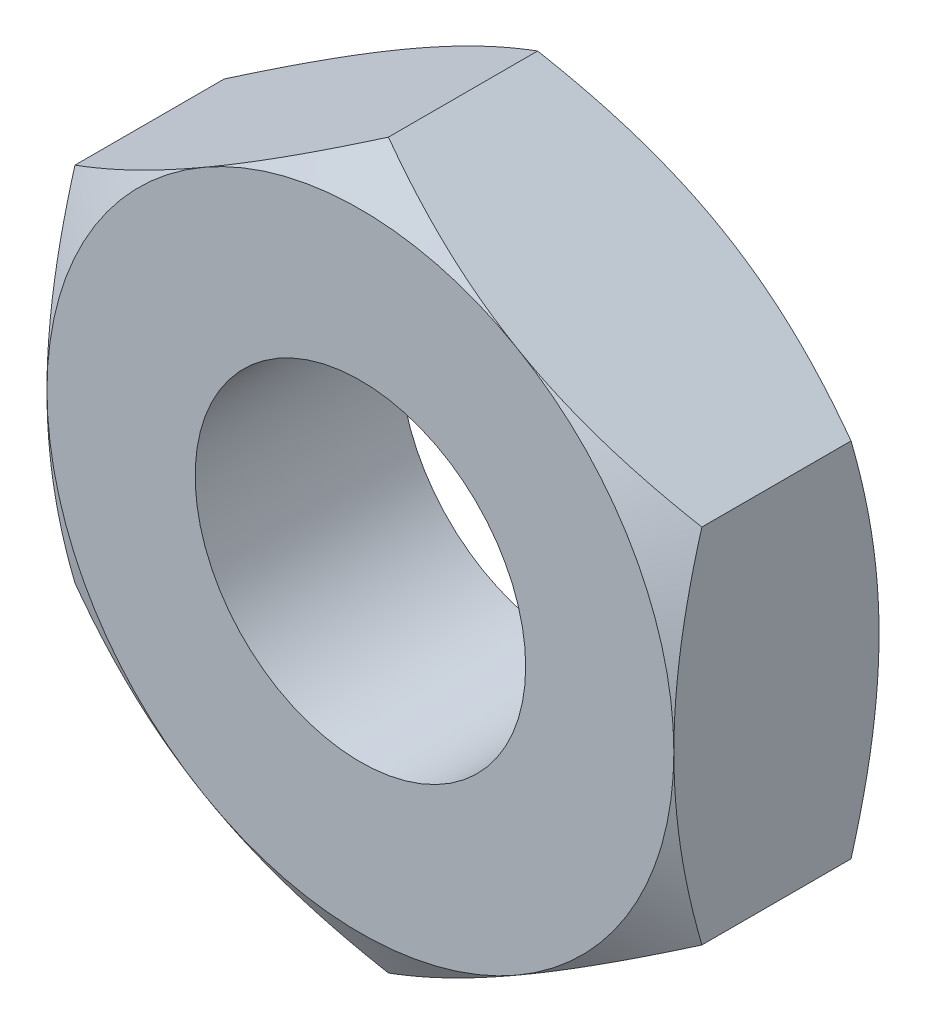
ISO-10303-21;
HEADER;
FILE_DESCRIPTION(('STEP AP214'),'2;1');
FILE_NAME('part.step','',(''),(''),'','','');
FILE_SCHEMA(('AUTOMOTIVE_DESIGN { 1 0 10303 214 1 1 1 1 }'));
ENDSEC;
DATA;
#1=APPLICATION_CONTEXT('core data for automotive mechanical design processes');
#2=APPLICATION_PROTOCOL_DEFINITION('international standard','automotive_design',2000,#1);
#3=PRODUCT_CONTEXT('',#1,'mechanical');
#4=PRODUCT('Part','Part','',(#3));
#5=PRODUCT_RELATED_PRODUCT_CATEGORY('part','',(#4));
#6=PRODUCT_DEFINITION_FORMATION('','',#4);
#7=PRODUCT_DEFINITION_CONTEXT('part definition',#1,'design');
#8=PRODUCT_DEFINITION('design','',#6,#7);
#9=PRODUCT_DEFINITION_SHAPE('','',#8);
#10=(LENGTH_UNIT() NAMED_UNIT(*) SI_UNIT(.MILLI.,.METRE.));
#11=(NAMED_UNIT(*) PLANE_ANGLE_UNIT() SI_UNIT($,.RADIAN.));
#12=(NAMED_UNIT(*) SI_UNIT($,.STERADIAN.) SOLID_ANGLE_UNIT());
#13=UNCERTAINTY_MEASURE_WITH_UNIT(LENGTH_MEASURE(1.E-05),#10,'distance_accuracy_value','');
#14=(GEOMETRIC_REPRESENTATION_CONTEXT(3) GLOBAL_UNCERTAINTY_ASSIGNED_CONTEXT((#13)) GLOBAL_UNIT_ASSIGNED_CONTEXT((#10,
#11,#12)) REPRESENTATION_CONTEXT('',''));
#15=CARTESIAN_POINT('',(0.,0.,0.));
#16=DIRECTION('',(0.,0.,1.));
#17=DIRECTION('',(1.,0.,0.));
#18=AXIS2_PLACEMENT_3D('',#15,#16,#17);
#19=CARTESIAN_POINT('',(0.,3.17542648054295,-1.8));
#20=DIRECTION('',(-0.500000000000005,0.866025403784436,0.));
#21=DIRECTION('',(-0.866025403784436,-0.500000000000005,0.));
#22=AXIS2_PLACEMENT_3D('',#19,#20,#21);
#23=PLANE('',#22);
#24=DIRECTION('',(0.,0.,1.));
#25=VECTOR('',#24,1.);
#26=CARTESIAN_POINT('',(-2.75,1.58771324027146,-1.8));
#27=LINE('',#26,#25);
#28=CARTESIAN_POINT('',(-2.75,1.58771324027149,-1.55437990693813));
#29=VERTEX_POINT('',#28);
#30=CARTESIAN_POINT('',(-2.75,1.58771324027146,-0.24562009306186));
#31=VERTEX_POINT('',#30);
#32=EDGE_CURVE('E153',#29,#31,#27,.T.);
#33=ORIENTED_EDGE('',*,*,#32,.T.);
#34=CARTESIAN_POINT('',(-2.7502,1.58759777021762,-0.245686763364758));
#35=CARTESIAN_POINT('',(-2.62935077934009,1.65737010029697,-0.20538766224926));
#36=CARTESIAN_POINT('',(-2.50745839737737,1.72774469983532,-0.168736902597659));
#37=CARTESIAN_POINT('',(-2.26156287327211,1.86971254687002,-0.104762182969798));
#38=CARTESIAN_POINT('',(-2.13755536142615,1.94130831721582,-0.0774608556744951));
#39=CARTESIAN_POINT('',(-1.89107720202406,2.08361254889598,-0.034961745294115));
#40=CARTESIAN_POINT('',(-1.76864448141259,2.15429911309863,-0.019481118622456));
#41=CARTESIAN_POINT('',(-1.52320285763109,2.29600490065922,-0.000999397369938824));
#42=CARTESIAN_POINT('',(-1.40019484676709,2.36702360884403,0.00201700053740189));
#43=CARTESIAN_POINT('',(-1.17034121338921,2.49972966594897,-0.00425314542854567));
#44=CARTESIAN_POINT('',(-1.06346120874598,2.56143686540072,-0.0120001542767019));
#45=CARTESIAN_POINT('',(-0.850397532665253,2.68444923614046,-0.0365551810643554));
#46=CARTESIAN_POINT('',(-0.744214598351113,2.74575398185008,-0.0533715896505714));
#47=CARTESIAN_POINT('',(-0.530711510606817,2.86902004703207,-0.0954119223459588));
#48=CARTESIAN_POINT('',(-0.423418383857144,2.93096576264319,-0.120814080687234));
#49=CARTESIAN_POINT('',(-0.210432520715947,3.05393320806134,-0.178467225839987));
#50=CARTESIAN_POINT('',(-0.104737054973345,3.11495651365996,-0.210704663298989));
#51=CARTESIAN_POINT('',(0.000200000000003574,3.17554195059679,-0.245686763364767));
#52=B_SPLINE_CURVE_WITH_KNOTS('',3,(#34,#35,#36,#37,#38,#39,#40,#41,#42,#43,#44,#45,#46,#47,#48,
#49,#50,#51),.UNSPECIFIED.,.F.,.F.,(4,2,2,2,2,2,2,2,4),(0.,0.435912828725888,0.872873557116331,
1.29901931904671,1.72464171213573,2.09526089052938,2.46622354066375,2.84541551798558,
3.22386274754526),.UNSPECIFIED.);
#53=CARTESIAN_POINT('',(-1.37500000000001,2.3815698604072,0.));
#54=VERTEX_POINT('',#53);
#55=EDGE_CURVE('E122',#31,#54,#52,.T.);
#56=ORIENTED_EDGE('',*,*,#55,.T.);
#57=CARTESIAN_POINT('',(0.,3.17542648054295,-0.245620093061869));
#58=VERTEX_POINT('',#57);
#59=EDGE_CURVE('E42',#54,#58,#52,.T.);
#60=ORIENTED_EDGE('',*,*,#59,.T.);
#61=DIRECTION('',(0.,0.,1.));
#62=VECTOR('',#61,1.);
#63=CARTESIAN_POINT('',(0.,3.17542648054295,-1.8));
#64=LINE('',#63,#62);
#65=CARTESIAN_POINT('',(0.,3.17542648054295,-1.55437990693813));
#66=VERTEX_POINT('',#65);
#67=EDGE_CURVE('E138',#66,#58,#64,.T.);
#68=ORIENTED_EDGE('',*,*,#67,.F.);
#69=CARTESIAN_POINT('',(-2.7502,1.58759777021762,-1.55431323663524));
#70=CARTESIAN_POINT('',(-2.62935077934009,1.65737010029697,-1.59461233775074));
#71=CARTESIAN_POINT('',(-2.50745839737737,1.72774469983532,-1.63126309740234));
#72=CARTESIAN_POINT('',(-2.26156287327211,1.86971254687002,-1.6952378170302));
#73=CARTESIAN_POINT('',(-2.13755536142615,1.94130831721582,-1.7225391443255));
#74=CARTESIAN_POINT('',(-1.89107720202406,2.08361254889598,-1.76503825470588));
#75=CARTESIAN_POINT('',(-1.76864448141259,2.15429911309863,-1.78051888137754));
#76=CARTESIAN_POINT('',(-1.52320285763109,2.29600490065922,-1.79900060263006));
#77=CARTESIAN_POINT('',(-1.40019484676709,2.36702360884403,-1.8020170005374));
#78=CARTESIAN_POINT('',(-1.17034121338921,2.49972966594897,-1.79574685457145));
#79=CARTESIAN_POINT('',(-1.06346120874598,2.56143686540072,-1.7879998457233));
#80=CARTESIAN_POINT('',(-0.850397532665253,2.68444923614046,-1.76344481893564));
#81=CARTESIAN_POINT('',(-0.744214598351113,2.74575398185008,-1.74662841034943));
#82=CARTESIAN_POINT('',(-0.530711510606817,2.86902004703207,-1.70458807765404));
#83=CARTESIAN_POINT('',(-0.423418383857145,2.93096576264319,-1.67918591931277));
#84=CARTESIAN_POINT('',(-0.210432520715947,3.05393320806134,-1.62153277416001));
#85=CARTESIAN_POINT('',(-0.104737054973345,3.11495651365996,-1.58929533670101));
#86=CARTESIAN_POINT('',(0.000200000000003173,3.17554195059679,-1.55431323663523));
#87=B_SPLINE_CURVE_WITH_KNOTS('',3,(#69,#70,#71,#72,#73,#74,#75,#76,#77,#78,#79,#80,#81,#82,#83,
#84,#85,#86),.UNSPECIFIED.,.F.,.F.,(4,2,2,2,2,2,2,2,4),(0.,0.435912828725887,0.872873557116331,
1.29901931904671,1.72464171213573,2.09526089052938,2.46622354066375,2.84541551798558,
3.22386274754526),.UNSPECIFIED.);
#88=CARTESIAN_POINT('',(-1.37500000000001,2.3815698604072,-1.8));
#89=VERTEX_POINT('',#88);
#90=EDGE_CURVE('E155',#89,#66,#87,.T.);
#91=ORIENTED_EDGE('',*,*,#90,.F.);
#92=EDGE_CURVE('E190',#29,#89,#87,.T.);
#93=ORIENTED_EDGE('',*,*,#92,.F.);
#94=EDGE_LOOP('',(#33,#56,#60,#68,#91,#93));
#95=FACE_BOUND('',#94,.T.);
#96=ADVANCED_FACE('F26',(#95),#23,.T.);
#97=CARTESIAN_POINT('',(2.75,1.58771324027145,-1.8));
#98=DIRECTION('',(0.500000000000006,0.866025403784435,0.));
#99=DIRECTION('',(-0.866025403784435,0.500000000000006,0.));
#100=AXIS2_PLACEMENT_3D('',#97,#98,#99);
#101=PLANE('',#100);
#102=ORIENTED_EDGE('',*,*,#67,.T.);
#103=CARTESIAN_POINT('',(-0.00019999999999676,3.17554195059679,-0.245686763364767));
#104=CARTESIAN_POINT('',(0.120649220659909,3.10576962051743,-0.205387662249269));
#105=CARTESIAN_POINT('',(0.242541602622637,3.03539502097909,-0.168736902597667));
#106=CARTESIAN_POINT('',(0.488437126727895,2.89342717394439,-0.104762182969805));
#107=CARTESIAN_POINT('',(0.612444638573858,2.82183140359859,-0.0774608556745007));
#108=CARTESIAN_POINT('',(0.858922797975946,2.67952717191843,-0.0349617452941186));
#109=CARTESIAN_POINT('',(0.98135551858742,2.60884060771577,-0.0194811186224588));
#110=CARTESIAN_POINT('',(1.22679714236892,2.46713482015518,-0.00099939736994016));
#111=CARTESIAN_POINT('',(1.34980515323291,2.39611611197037,0.00201700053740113));
#112=CARTESIAN_POINT('',(1.57965878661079,2.26341005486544,-0.00425314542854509));
#113=CARTESIAN_POINT('',(1.68653879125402,2.20170285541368,-0.0120001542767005));
#114=CARTESIAN_POINT('',(1.89960246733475,2.07869048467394,-0.0365551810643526));
#115=CARTESIAN_POINT('',(2.00578540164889,2.01738573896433,-0.0533715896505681));
#116=CARTESIAN_POINT('',(2.21928848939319,1.89411967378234,-0.0954119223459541));
#117=CARTESIAN_POINT('',(2.32658161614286,1.83217395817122,-0.120814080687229));
#118=CARTESIAN_POINT('',(2.53956747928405,1.70920651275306,-0.17846722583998));
#119=CARTESIAN_POINT('',(2.64526294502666,1.64818320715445,-0.21070466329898));
#120=CARTESIAN_POINT('',(2.7502,1.58759777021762,-0.245686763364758));
#121=B_SPLINE_CURVE_WITH_KNOTS('',3,(#103,#104,#105,#106,#107,#108,#109,#110,#111,#112,#113,
#114,#115,#116,#117,#118,#119,#120),.UNSPECIFIED.,.F.,.F.,(4,2,2,2,2,2,2,2,4),(0.,
0.43591282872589,0.872873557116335,1.29901931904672,1.72464171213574,2.09526089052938,
2.46622354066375,2.84541551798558,3.22386274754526),.UNSPECIFIED.);
#122=CARTESIAN_POINT('',(1.37500000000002,2.3815698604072,0.));
#123=VERTEX_POINT('',#122);
#124=EDGE_CURVE('E132',#58,#123,#121,.T.);
#125=ORIENTED_EDGE('',*,*,#124,.T.);
#126=CARTESIAN_POINT('',(2.75,1.58771324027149,-0.245620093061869));
#127=VERTEX_POINT('',#126);
#128=EDGE_CURVE('E49',#123,#127,#121,.T.);
#129=ORIENTED_EDGE('',*,*,#128,.T.);
#130=DIRECTION('',(0.,0.,1.));
#131=VECTOR('',#130,1.);
#132=CARTESIAN_POINT('',(2.75,1.58771324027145,-1.8));
#133=LINE('',#132,#131);
#134=CARTESIAN_POINT('',(2.75,1.58771324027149,-1.55437990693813));
#135=VERTEX_POINT('',#134);
#136=EDGE_CURVE('E131',#135,#127,#133,.T.);
#137=ORIENTED_EDGE('',*,*,#136,.F.);
#138=CARTESIAN_POINT('',(-0.00019999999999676,3.17554195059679,-1.55431323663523));
#139=CARTESIAN_POINT('',(0.120649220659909,3.10576962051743,-1.59461233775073));
#140=CARTESIAN_POINT('',(0.242541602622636,3.03539502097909,-1.63126309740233));
#141=CARTESIAN_POINT('',(0.488437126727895,2.89342717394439,-1.6952378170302));
#142=CARTESIAN_POINT('',(0.612444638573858,2.82183140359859,-1.7225391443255));
#143=CARTESIAN_POINT('',(0.858922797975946,2.67952717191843,-1.76503825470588));
#144=CARTESIAN_POINT('',(0.981355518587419,2.60884060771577,-1.78051888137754));
#145=CARTESIAN_POINT('',(1.22679714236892,2.46713482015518,-1.79900060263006));
#146=CARTESIAN_POINT('',(1.34980515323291,2.39611611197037,-1.8020170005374));
#147=CARTESIAN_POINT('',(1.57965878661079,2.26341005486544,-1.79574685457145));
#148=CARTESIAN_POINT('',(1.68653879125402,2.20170285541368,-1.7879998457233));
#149=CARTESIAN_POINT('',(1.89960246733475,2.07869048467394,-1.76344481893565));
#150=CARTESIAN_POINT('',(2.00578540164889,2.01738573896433,-1.74662841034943));
#151=CARTESIAN_POINT('',(2.21928848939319,1.89411967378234,-1.70458807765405));
#152=CARTESIAN_POINT('',(2.32658161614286,1.83217395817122,-1.67918591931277));
#153=CARTESIAN_POINT('',(2.53956747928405,1.70920651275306,-1.62153277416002));
#154=CARTESIAN_POINT('',(2.64526294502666,1.64818320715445,-1.58929533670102));
#155=CARTESIAN_POINT('',(2.7502,1.58759777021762,-1.55431323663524));
#156=B_SPLINE_CURVE_WITH_KNOTS('',3,(#138,#139,#140,#141,#142,#143,#144,#145,#146,#147,#148,
#149,#150,#151,#152,#153,#154,#155),.UNSPECIFIED.,.F.,.F.,(4,2,2,2,2,2,2,2,4),(0.,
0.43591282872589,0.872873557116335,1.29901931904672,1.72464171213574,2.09526089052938,
2.46622354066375,2.84541551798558,3.22386274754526),.UNSPECIFIED.);
#157=CARTESIAN_POINT('',(1.37500000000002,2.3815698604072,-1.8));
#158=VERTEX_POINT('',#157);
#159=EDGE_CURVE('E200',#158,#135,#156,.T.);
#160=ORIENTED_EDGE('',*,*,#159,.F.);
#161=EDGE_CURVE('E201',#66,#158,#156,.T.);
#162=ORIENTED_EDGE('',*,*,#161,.F.);
#163=EDGE_LOOP('',(#102,#125,#129,#137,#160,#162));
#164=FACE_BOUND('',#163,.T.);
#165=ADVANCED_FACE('F129',(#164),#101,.T.);
#166=CARTESIAN_POINT('',(2.75,1.58771324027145,-1.8));
#167=DIRECTION('',(-1.,0.,0.));
#168=DIRECTION('',(0.,0.,1.));
#169=AXIS2_PLACEMENT_3D('',#166,#167,#168);
#170=PLANE('',#169);
#171=CARTESIAN_POINT('',(2.75,-4.21084949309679,-1.31594843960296));
#172=CARTESIAN_POINT('',(2.75,-4.09010894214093,-1.25759993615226));
#173=CARTESIAN_POINT('',(2.75,-3.96908292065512,-1.1998314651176));
#174=CARTESIAN_POINT('',(2.75,-3.72630558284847,-1.08578603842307));
#175=CARTESIAN_POINT('',(2.75,-3.60455414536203,-1.02950934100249));
#176=CARTESIAN_POINT('',(2.75,-3.35951393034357,-0.918482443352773));
#177=CARTESIAN_POINT('',(2.75,-3.23622034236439,-0.863742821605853));
#178=CARTESIAN_POINT('',(2.75,-2.98861980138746,-0.756614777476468));
#179=CARTESIAN_POINT('',(2.75,-2.86431290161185,-0.704226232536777));
#180=CARTESIAN_POINT('',(2.75,-2.61294485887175,-0.601803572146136));
#181=CARTESIAN_POINT('',(2.75,-2.48586863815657,-0.551806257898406));
#182=CARTESIAN_POINT('',(2.75,-2.23021732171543,-0.455727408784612));
#183=CARTESIAN_POINT('',(2.75,-2.10164206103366,-0.409646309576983));
#184=CARTESIAN_POINT('',(2.75,-1.8430521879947,-0.322638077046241));
#185=CARTESIAN_POINT('',(2.75,-1.71304130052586,-0.281699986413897));
#186=CARTESIAN_POINT('',(2.75,-1.4511712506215,-0.206307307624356));
#187=CARTESIAN_POINT('',(2.75,-1.31931268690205,-0.171850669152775));
#188=CARTESIAN_POINT('',(2.75,-1.05365722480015,-0.11109367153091));
#189=CARTESIAN_POINT('',(2.75,-0.919859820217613,-0.0847954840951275));
#190=CARTESIAN_POINT('',(2.75,-0.650651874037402,-0.042126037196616));
#191=CARTESIAN_POINT('',(2.75,-0.515241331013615,-0.0257547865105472));
#192=CARTESIAN_POINT('',(2.75,-0.24437324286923,-0.00438749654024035));
#193=CARTESIAN_POINT('',(2.75,-0.108921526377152,0.000680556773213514));
#194=CARTESIAN_POINT('',(2.75,0.161887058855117,-0.000827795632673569));
#195=CARTESIAN_POINT('',(2.75,0.297243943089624,-0.00740117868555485));
#196=CARTESIAN_POINT('',(2.75,0.528385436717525,-0.0281041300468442));
#197=CARTESIAN_POINT('',(2.75,0.624425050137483,-0.0395376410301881));
#198=CARTESIAN_POINT('',(2.75,0.815762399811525,-0.0675217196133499));
#199=CARTESIAN_POINT('',(2.75,0.911060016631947,-0.0840730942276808));
#200=CARTESIAN_POINT('',(2.75,1.19576218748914,-0.140535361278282));
#201=CARTESIAN_POINT('',(2.75,1.38383224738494,-0.18723985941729));
#202=CARTESIAN_POINT('',(2.75,1.66525048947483,-0.267792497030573));
#203=CARTESIAN_POINT('',(2.75,1.76006556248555,-0.296803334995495));
#204=CARTESIAN_POINT('',(2.75,1.94870609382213,-0.357695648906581));
#205=CARTESIAN_POINT('',(2.75,2.04253218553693,-0.389575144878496));
#206=CARTESIAN_POINT('',(2.75,2.22880240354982,-0.455541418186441));
#207=CARTESIAN_POINT('',(2.75,2.32125133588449,-0.489614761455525));
#208=CARTESIAN_POINT('',(2.75,2.50543192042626,-0.5597613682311));
#209=CARTESIAN_POINT('',(2.75,2.59716326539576,-0.595835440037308));
#210=CARTESIAN_POINT('',(2.75,2.68856293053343,-0.632712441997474));
#211=B_SPLINE_CURVE_WITH_KNOTS('',3,(#171,#172,#173,#174,#175,#176,#177,#178,#179,#180,#181,
#182,#183,#184,#185,#186,#187,#188,#189,#190,#191,#192,#193,#194,#195,#196,#197,#198,#199,#200,
#201,#202,#203,#204,#205,#206,#207,#208,#209,#210),.UNSPECIFIED.,.F.,.F.,(4,2,2,2,2,2,2,2,2,2,2,
2,2,2,2,2,2,2,2,4),(0.,0.402305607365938,0.804680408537,1.20935783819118,1.61401414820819,
2.02363838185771,2.4333081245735,2.84208969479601,3.25074173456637,3.65950246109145,
4.06826354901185,4.47441284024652,4.88045669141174,5.17046846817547,5.46052599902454,
6.04107275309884,6.33851131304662,6.63574613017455,6.93130791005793,7.22698998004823),.UNSPECIFIED.);
#212=CARTESIAN_POINT('',(2.74999999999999,-1.58771324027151,-0.245620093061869));
#213=VERTEX_POINT('',#212);
#214=CARTESIAN_POINT('',(2.75,0.,0.));
#215=VERTEX_POINT('',#214);
#216=EDGE_CURVE('E124',#213,#215,#211,.T.);
#217=ORIENTED_EDGE('',*,*,#216,.F.);
#218=DIRECTION('',(0.,0.,1.));
#219=VECTOR('',#218,1.);
#220=CARTESIAN_POINT('',(2.75,-1.5877132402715,-1.8));
#221=LINE('',#220,#219);
#222=CARTESIAN_POINT('',(2.74999999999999,-1.58771324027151,-1.55437990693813));
#223=VERTEX_POINT('',#222);
#224=EDGE_CURVE('E139',#223,#213,#221,.T.);
#225=ORIENTED_EDGE('',*,*,#224,.F.);
#226=CARTESIAN_POINT('',(2.75,-4.21084949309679,-0.484051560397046));
#227=CARTESIAN_POINT('',(2.75,-4.09010894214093,-0.542400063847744));
#228=CARTESIAN_POINT('',(2.75,-3.96908292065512,-0.600168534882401));
#229=CARTESIAN_POINT('',(2.75,-3.72630558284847,-0.714213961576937));
#230=CARTESIAN_POINT('',(2.75,-3.60455414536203,-0.770490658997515));
#231=CARTESIAN_POINT('',(2.75,-3.35951393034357,-0.881517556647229));
#232=CARTESIAN_POINT('',(2.75,-3.23622034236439,-0.936257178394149));
#233=CARTESIAN_POINT('',(2.75,-2.98861980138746,-1.04338522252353));
#234=CARTESIAN_POINT('',(2.75,-2.86431290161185,-1.09577376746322));
#235=CARTESIAN_POINT('',(2.75,-2.61294485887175,-1.19819642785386));
#236=CARTESIAN_POINT('',(2.75,-2.48586863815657,-1.24819374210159));
#237=CARTESIAN_POINT('',(2.75,-2.23021732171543,-1.34427259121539));
#238=CARTESIAN_POINT('',(2.75,-2.10164206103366,-1.39035369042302));
#239=CARTESIAN_POINT('',(2.75,-1.8430521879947,-1.47736192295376));
#240=CARTESIAN_POINT('',(2.75,-1.71304130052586,-1.5183000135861));
#241=CARTESIAN_POINT('',(2.75,-1.4511712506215,-1.59369269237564));
#242=CARTESIAN_POINT('',(2.75,-1.31931268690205,-1.62814933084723));
#243=CARTESIAN_POINT('',(2.75,-1.05365722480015,-1.68890632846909));
#244=CARTESIAN_POINT('',(2.75,-0.919859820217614,-1.71520451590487));
#245=CARTESIAN_POINT('',(2.75,-0.650651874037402,-1.75787396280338));
#246=CARTESIAN_POINT('',(2.75,-0.515241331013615,-1.77424521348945));
#247=CARTESIAN_POINT('',(2.75,-0.24437324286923,-1.79561250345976));
#248=CARTESIAN_POINT('',(2.75,-0.108921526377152,-1.80068055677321));
#249=CARTESIAN_POINT('',(2.75,0.161887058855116,-1.79917220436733));
#250=CARTESIAN_POINT('',(2.75,0.297243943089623,-1.79259882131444));
#251=CARTESIAN_POINT('',(2.75,0.528385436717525,-1.77189586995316));
#252=CARTESIAN_POINT('',(2.75,0.624425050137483,-1.76046235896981));
#253=CARTESIAN_POINT('',(2.75,0.815762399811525,-1.73247828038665));
#254=CARTESIAN_POINT('',(2.75,0.911060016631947,-1.71592690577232));
#255=CARTESIAN_POINT('',(2.75,1.19576218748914,-1.65946463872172));
#256=CARTESIAN_POINT('',(2.75,1.38383224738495,-1.61276014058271));
#257=CARTESIAN_POINT('',(2.75,1.66525048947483,-1.53220750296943));
#258=CARTESIAN_POINT('',(2.75,1.76006556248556,-1.5031966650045));
#259=CARTESIAN_POINT('',(2.75,1.94870609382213,-1.44230435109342));
#260=CARTESIAN_POINT('',(2.75,2.04253218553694,-1.4104248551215));
#261=CARTESIAN_POINT('',(2.75,2.22880240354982,-1.34445858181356));
#262=CARTESIAN_POINT('',(2.75,2.32125133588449,-1.31038523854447));
#263=CARTESIAN_POINT('',(2.75,2.50543192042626,-1.2402386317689));
#264=CARTESIAN_POINT('',(2.75,2.59716326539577,-1.20416455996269));
#265=CARTESIAN_POINT('',(2.75,2.68856293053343,-1.16728755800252));
#266=B_SPLINE_CURVE_WITH_KNOTS('',3,(#226,#227,#228,#229,#230,#231,#232,#233,#234,#235,#236,
#237,#238,#239,#240,#241,#242,#243,#244,#245,#246,#247,#248,#249,#250,#251,#252,#253,#254,#255,
#256,#257,#258,#259,#260,#261,#262,#263,#264,#265),.UNSPECIFIED.,.F.,.F.,(4,2,2,2,2,2,2,2,2,2,2,
2,2,2,2,2,2,2,2,4),(0.,0.402305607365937,0.804680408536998,1.20935783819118,1.61401414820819,
2.0236383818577,2.43330812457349,2.84208969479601,3.25074173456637,3.65950246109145,
4.06826354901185,4.47441284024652,4.88045669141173,5.17046846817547,5.46052599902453,
6.04107275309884,6.33851131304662,6.63574613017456,6.93130791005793,7.22698998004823),.UNSPECIFIED.);
#267=CARTESIAN_POINT('',(2.75,0.,-1.8));
#268=VERTEX_POINT('',#267);
#269=EDGE_CURVE('E177',#223,#268,#266,.T.);
#270=ORIENTED_EDGE('',*,*,#269,.T.);
#271=EDGE_CURVE('E137',#268,#135,#266,.T.);
#272=ORIENTED_EDGE('',*,*,#271,.T.);
#273=ORIENTED_EDGE('',*,*,#136,.T.);
#274=EDGE_CURVE('E114',#215,#127,#211,.T.);
#275=ORIENTED_EDGE('',*,*,#274,.F.);
#276=EDGE_LOOP('',(#217,#225,#270,#272,#273,#275));
#277=FACE_BOUND('',#276,.T.);
#278=ADVANCED_FACE('F135',(#277),#170,.F.);
#279=CARTESIAN_POINT('',(0.,-3.17542648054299,-1.8));
#280=DIRECTION('',(0.500000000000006,-0.866025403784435,0.));
#281=DIRECTION('',(0.866025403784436,0.500000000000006,0.));
#282=AXIS2_PLACEMENT_3D('',#279,#280,#281);
#283=PLANE('',#282);
#284=ORIENTED_EDGE('',*,*,#224,.T.);
#285=CARTESIAN_POINT('',(2.7502,-1.58759777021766,-0.245686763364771));
#286=CARTESIAN_POINT('',(2.6293507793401,-1.65737010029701,-0.205387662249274));
#287=CARTESIAN_POINT('',(2.50745839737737,-1.72774469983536,-0.168736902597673));
#288=CARTESIAN_POINT('',(2.26156287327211,-1.86971254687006,-0.104762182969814));
#289=CARTESIAN_POINT('',(2.13755536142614,-1.94130831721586,-0.077460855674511));
#290=CARTESIAN_POINT('',(1.89107720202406,-2.08361254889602,-0.0349617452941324));
#291=CARTESIAN_POINT('',(1.76864448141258,-2.15429911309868,-0.0194811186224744));
#292=CARTESIAN_POINT('',(1.52320285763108,-2.29600490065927,-0.000999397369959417));
#293=CARTESIAN_POINT('',(1.40019484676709,-2.36702360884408,0.00201700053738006));
#294=CARTESIAN_POINT('',(1.1703412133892,-2.49972966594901,-0.00425314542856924));
#295=CARTESIAN_POINT('',(1.06346120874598,-2.56143686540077,-0.0120001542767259));
#296=CARTESIAN_POINT('',(0.850397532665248,-2.68444923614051,-0.0365551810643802));
#297=CARTESIAN_POINT('',(0.744214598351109,-2.74575398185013,-0.0533715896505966));
#298=CARTESIAN_POINT('',(0.530711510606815,-2.86902004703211,-0.0954119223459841));
#299=CARTESIAN_POINT('',(0.423418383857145,-2.93096576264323,-0.120814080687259));
#300=CARTESIAN_POINT('',(0.210432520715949,-3.05393320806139,-0.178467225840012));
#301=CARTESIAN_POINT('',(0.104737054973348,-3.11495651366,-0.210704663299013));
#302=CARTESIAN_POINT('',(-0.000199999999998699,-3.17554195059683,-0.245686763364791));
#303=B_SPLINE_CURVE_WITH_KNOTS('',3,(#285,#286,#287,#288,#289,#290,#291,#292,#293,#294,#295,
#296,#297,#298,#299,#300,#301,#302),.UNSPECIFIED.,.F.,.F.,(4,2,2,2,2,2,2,2,4),(0.,
0.435912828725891,0.872873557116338,1.29901931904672,1.72464171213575,2.09526089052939,
2.46622354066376,2.84541551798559,3.22386274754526),.UNSPECIFIED.);
#304=CARTESIAN_POINT('',(1.37500000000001,-2.3815698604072,0.));
#305=VERTEX_POINT('',#304);
#306=EDGE_CURVE('E257',#213,#305,#303,.T.);
#307=ORIENTED_EDGE('',*,*,#306,.T.);
#308=CARTESIAN_POINT('',(0.,-3.17542648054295,-0.245620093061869));
#309=VERTEX_POINT('',#308);
#310=EDGE_CURVE('E251',#305,#309,#303,.T.);
#311=ORIENTED_EDGE('',*,*,#310,.T.);
#312=DIRECTION('',(0.,0.,1.));
#313=VECTOR('',#312,1.);
#314=CARTESIAN_POINT('',(0.,-3.17542648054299,-1.8));
#315=LINE('',#314,#313);
#316=CARTESIAN_POINT('',(0.,-3.17542648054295,-1.55437990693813));
#317=VERTEX_POINT('',#316);
#318=EDGE_CURVE('E144',#317,#309,#315,.T.);
#319=ORIENTED_EDGE('',*,*,#318,.F.);
#320=CARTESIAN_POINT('',(2.7502,-1.58759777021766,-1.55431323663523));
#321=CARTESIAN_POINT('',(2.6293507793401,-1.65737010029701,-1.59461233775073));
#322=CARTESIAN_POINT('',(2.50745839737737,-1.72774469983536,-1.63126309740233));
#323=CARTESIAN_POINT('',(2.26156287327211,-1.86971254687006,-1.69523781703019));
#324=CARTESIAN_POINT('',(2.13755536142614,-1.94130831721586,-1.72253914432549));
#325=CARTESIAN_POINT('',(1.89107720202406,-2.08361254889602,-1.76503825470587));
#326=CARTESIAN_POINT('',(1.76864448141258,-2.15429911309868,-1.78051888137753));
#327=CARTESIAN_POINT('',(1.52320285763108,-2.29600490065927,-1.79900060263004));
#328=CARTESIAN_POINT('',(1.40019484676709,-2.36702360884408,-1.80201700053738));
#329=CARTESIAN_POINT('',(1.17034121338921,-2.49972966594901,-1.79574685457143));
#330=CARTESIAN_POINT('',(1.06346120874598,-2.56143686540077,-1.78799984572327));
#331=CARTESIAN_POINT('',(0.85039753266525,-2.68444923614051,-1.76344481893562));
#332=CARTESIAN_POINT('',(0.74421459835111,-2.74575398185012,-1.7466284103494));
#333=CARTESIAN_POINT('',(0.530711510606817,-2.86902004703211,-1.70458807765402));
#334=CARTESIAN_POINT('',(0.423418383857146,-2.93096576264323,-1.67918591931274));
#335=CARTESIAN_POINT('',(0.21043252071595,-3.05393320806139,-1.62153277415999));
#336=CARTESIAN_POINT('',(0.104737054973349,-3.11495651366,-1.58929533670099));
#337=CARTESIAN_POINT('',(-0.00019999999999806,-3.17554195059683,-1.55431323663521));
#338=B_SPLINE_CURVE_WITH_KNOTS('',3,(#320,#321,#322,#323,#324,#325,#326,#327,#328,#329,#330,
#331,#332,#333,#334,#335,#336,#337),.UNSPECIFIED.,.F.,.F.,(4,2,2,2,2,2,2,2,4),(0.,
0.435912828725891,0.872873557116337,1.29901931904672,1.72464171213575,2.09526089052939,
2.46622354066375,2.84541551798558,3.22386274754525),.UNSPECIFIED.);
#339=CARTESIAN_POINT('',(1.37500000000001,-2.3815698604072,-1.8));
#340=VERTEX_POINT('',#339);
#341=EDGE_CURVE('E193',#340,#317,#338,.T.);
#342=ORIENTED_EDGE('',*,*,#341,.F.);
#343=EDGE_CURVE('E179',#223,#340,#338,.T.);
#344=ORIENTED_EDGE('',*,*,#343,.F.);
#345=EDGE_LOOP('',(#284,#307,#311,#319,#342,#344));
#346=FACE_BOUND('',#345,.T.);
#347=ADVANCED_FACE('F242',(#346),#283,.T.);
#348=CARTESIAN_POINT('',(-2.75,-1.5877132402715,-1.8));
#349=DIRECTION('',(-0.500000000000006,-0.866025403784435,0.));
#350=DIRECTION('',(0.866025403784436,-0.500000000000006,0.));
#351=AXIS2_PLACEMENT_3D('',#348,#349,#350);
#352=PLANE('',#351);
#353=ORIENTED_EDGE('',*,*,#318,.T.);
#354=CARTESIAN_POINT('',(0.000200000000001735,-3.17554195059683,-0.245686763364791));
#355=CARTESIAN_POINT('',(-0.120649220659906,-3.10576962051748,-0.205387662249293));
#356=CARTESIAN_POINT('',(-0.242541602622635,-3.03539502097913,-0.168736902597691));
#357=CARTESIAN_POINT('',(-0.488437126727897,-2.89342717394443,-0.104762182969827));
#358=CARTESIAN_POINT('',(-0.612444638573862,-2.82183140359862,-0.0774608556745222));
#359=CARTESIAN_POINT('',(-0.858922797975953,-2.67952717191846,-0.0349617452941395));
#360=CARTESIAN_POINT('',(-0.981355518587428,-2.60884060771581,-0.0194811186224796));
#361=CARTESIAN_POINT('',(-1.22679714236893,-2.46713482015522,-0.000999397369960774));
#362=CARTESIAN_POINT('',(-1.34980515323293,-2.39611611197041,0.00201700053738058));
#363=CARTESIAN_POINT('',(-1.57965878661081,-2.26341005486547,-0.00425314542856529));
#364=CARTESIAN_POINT('',(-1.68653879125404,-2.20170285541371,-0.0120001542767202));
#365=CARTESIAN_POINT('',(-1.89960246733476,-2.07869048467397,-0.0365551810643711));
#366=CARTESIAN_POINT('',(-2.0057854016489,-2.01738573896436,-0.0533715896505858));
#367=CARTESIAN_POINT('',(-2.21928848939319,-1.89411967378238,-0.0954119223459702));
#368=CARTESIAN_POINT('',(-2.32658161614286,-1.83217395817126,-0.120814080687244));
#369=CARTESIAN_POINT('',(-2.53956747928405,-1.7092065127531,-0.178467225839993));
#370=CARTESIAN_POINT('',(-2.64526294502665,-1.64818320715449,-0.210704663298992));
#371=CARTESIAN_POINT('',(-2.7502,-1.58759777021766,-0.245686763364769));
#372=B_SPLINE_CURVE_WITH_KNOTS('',3,(#354,#355,#356,#357,#358,#359,#360,#361,#362,#363,#364,
#365,#366,#367,#368,#369,#370,#371),.UNSPECIFIED.,.F.,.F.,(4,2,2,2,2,2,2,2,4),(0.,
0.435912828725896,0.872873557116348,1.29901931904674,1.72464171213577,2.0952608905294,
2.46622354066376,2.84541551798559,3.22386274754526),.UNSPECIFIED.);
#373=CARTESIAN_POINT('',(-1.37500000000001,-2.3815698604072,0.));
#374=VERTEX_POINT('',#373);
#375=EDGE_CURVE('E258',#309,#374,#372,.T.);
#376=ORIENTED_EDGE('',*,*,#375,.T.);
#377=CARTESIAN_POINT('',(-2.75,-1.58771324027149,-0.245620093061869));
#378=VERTEX_POINT('',#377);
#379=EDGE_CURVE('E259',#374,#378,#372,.T.);
#380=ORIENTED_EDGE('',*,*,#379,.T.);
#381=DIRECTION('',(0.,0.,1.));
#382=VECTOR('',#381,1.);
#383=CARTESIAN_POINT('',(-2.75,-1.5877132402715,-1.8));
#384=LINE('',#383,#382);
#385=CARTESIAN_POINT('',(-2.75,-1.58771324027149,-1.55437990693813));
#386=VERTEX_POINT('',#385);
#387=EDGE_CURVE('E150',#386,#378,#384,.T.);
#388=ORIENTED_EDGE('',*,*,#387,.F.);
#389=CARTESIAN_POINT('',(0.000200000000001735,-3.17554195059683,-1.55431323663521));
#390=CARTESIAN_POINT('',(-0.120649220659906,-3.10576962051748,-1.59461233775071));
#391=CARTESIAN_POINT('',(-0.242541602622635,-3.03539502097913,-1.63126309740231));
#392=CARTESIAN_POINT('',(-0.488437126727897,-2.89342717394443,-1.69523781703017));
#393=CARTESIAN_POINT('',(-0.612444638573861,-2.82183140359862,-1.72253914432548));
#394=CARTESIAN_POINT('',(-0.858922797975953,-2.67952717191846,-1.76503825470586));
#395=CARTESIAN_POINT('',(-0.981355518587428,-2.60884060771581,-1.78051888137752));
#396=CARTESIAN_POINT('',(-1.22679714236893,-2.46713482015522,-1.79900060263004));
#397=CARTESIAN_POINT('',(-1.34980515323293,-2.39611611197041,-1.80201700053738));
#398=CARTESIAN_POINT('',(-1.57965878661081,-2.26341005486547,-1.79574685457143));
#399=CARTESIAN_POINT('',(-1.68653879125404,-2.20170285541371,-1.78799984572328));
#400=CARTESIAN_POINT('',(-1.89960246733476,-2.07869048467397,-1.76344481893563));
#401=CARTESIAN_POINT('',(-2.0057854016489,-2.01738573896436,-1.74662841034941));
#402=CARTESIAN_POINT('',(-2.21928848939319,-1.89411967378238,-1.70458807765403));
#403=CARTESIAN_POINT('',(-2.32658161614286,-1.83217395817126,-1.67918591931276));
#404=CARTESIAN_POINT('',(-2.53956747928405,-1.7092065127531,-1.62153277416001));
#405=CARTESIAN_POINT('',(-2.64526294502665,-1.64818320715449,-1.58929533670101));
#406=CARTESIAN_POINT('',(-2.7502,-1.58759777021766,-1.55431323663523));
#407=B_SPLINE_CURVE_WITH_KNOTS('',3,(#389,#390,#391,#392,#393,#394,#395,#396,#397,#398,#399,
#400,#401,#402,#403,#404,#405,#406),.UNSPECIFIED.,.F.,.F.,(4,2,2,2,2,2,2,2,4),(0.,
0.435912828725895,0.872873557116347,1.29901931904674,1.72464171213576,2.0952608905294,
2.46622354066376,2.84541551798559,3.22386274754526),.UNSPECIFIED.);
#408=CARTESIAN_POINT('',(-1.37500000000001,-2.3815698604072,-1.8));
#409=VERTEX_POINT('',#408);
#410=EDGE_CURVE('E231',#409,#386,#407,.T.);
#411=ORIENTED_EDGE('',*,*,#410,.F.);
#412=EDGE_CURVE('E241',#317,#409,#407,.T.);
#413=ORIENTED_EDGE('',*,*,#412,.F.);
#414=EDGE_LOOP('',(#353,#376,#380,#388,#411,#413));
#415=FACE_BOUND('',#414,.T.);
#416=ADVANCED_FACE('F245',(#415),#352,.T.);
#417=CARTESIAN_POINT('',(-2.75,1.58771324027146,-1.8));
#418=DIRECTION('',(-1.,0.,0.));
#419=DIRECTION('',(0.,0.,1.));
#420=AXIS2_PLACEMENT_3D('',#417,#418,#419);
#421=PLANE('',#420);
#422=ORIENTED_EDGE('',*,*,#387,.T.);
#423=CARTESIAN_POINT('',(-2.75,-4.21084949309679,-1.31594843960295));
#424=CARTESIAN_POINT('',(-2.75,-4.09010894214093,-1.25759993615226));
#425=CARTESIAN_POINT('',(-2.75,-3.96908292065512,-1.1998314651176));
#426=CARTESIAN_POINT('',(-2.75,-3.72630558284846,-1.08578603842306));
#427=CARTESIAN_POINT('',(-2.75,-3.60455414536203,-1.02950934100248));
#428=CARTESIAN_POINT('',(-2.75,-3.35951393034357,-0.918482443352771));
#429=CARTESIAN_POINT('',(-2.75,-3.23622034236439,-0.863742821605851));
#430=CARTESIAN_POINT('',(-2.75,-2.98861980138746,-0.756614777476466));
#431=CARTESIAN_POINT('',(-2.75,-2.86431290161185,-0.704226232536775));
#432=CARTESIAN_POINT('',(-2.75,-2.61294485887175,-0.601803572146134));
#433=CARTESIAN_POINT('',(-2.75,-2.48586863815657,-0.551806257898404));
#434=CARTESIAN_POINT('',(-2.75,-2.23021732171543,-0.455727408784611));
#435=CARTESIAN_POINT('',(-2.75,-2.10164206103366,-0.409646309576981));
#436=CARTESIAN_POINT('',(-2.75,-1.8430521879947,-0.322638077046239));
#437=CARTESIAN_POINT('',(-2.75,-1.71304130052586,-0.281699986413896));
#438=CARTESIAN_POINT('',(-2.75,-1.4511712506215,-0.206307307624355));
#439=CARTESIAN_POINT('',(-2.75,-1.31931268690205,-0.171850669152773));
#440=CARTESIAN_POINT('',(-2.75,-1.05365722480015,-0.111093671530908));
#441=CARTESIAN_POINT('',(-2.75,-0.919859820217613,-0.0847954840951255));
#442=CARTESIAN_POINT('',(-2.75,-0.650651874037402,-0.042126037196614));
#443=CARTESIAN_POINT('',(-2.75,-0.515241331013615,-0.0257547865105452));
#444=CARTESIAN_POINT('',(-2.75,-0.24437324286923,-0.00438749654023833));
#445=CARTESIAN_POINT('',(-2.75,-0.108921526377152,0.000680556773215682));
#446=CARTESIAN_POINT('',(-2.75,0.161887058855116,-0.000827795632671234));
#447=CARTESIAN_POINT('',(-2.75,0.297243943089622,-0.00740117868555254));
#448=CARTESIAN_POINT('',(-2.75,0.528385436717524,-0.0281041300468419));
#449=CARTESIAN_POINT('',(-2.75,0.624425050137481,-0.0395376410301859));
#450=CARTESIAN_POINT('',(-2.75,0.815762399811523,-0.0675217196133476));
#451=CARTESIAN_POINT('',(-2.75,0.911060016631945,-0.0840730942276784));
#452=CARTESIAN_POINT('',(-2.75,1.19576218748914,-0.140535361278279));
#453=CARTESIAN_POINT('',(-2.75,1.38383224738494,-0.187239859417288));
#454=CARTESIAN_POINT('',(-2.75,1.66525048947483,-0.267792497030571));
#455=CARTESIAN_POINT('',(-2.75,1.76006556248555,-0.296803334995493));
#456=CARTESIAN_POINT('',(-2.75,1.94870609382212,-0.357695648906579));
#457=CARTESIAN_POINT('',(-2.75,2.04253218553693,-0.389575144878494));
#458=CARTESIAN_POINT('',(-2.75,2.22880240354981,-0.455541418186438));
#459=CARTESIAN_POINT('',(-2.75,2.32125133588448,-0.489614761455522));
#460=CARTESIAN_POINT('',(-2.75,2.50543192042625,-0.559761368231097));
#461=CARTESIAN_POINT('',(-2.75,2.59716326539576,-0.595835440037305));
#462=CARTESIAN_POINT('',(-2.75,2.68856293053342,-0.632712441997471));
#463=B_SPLINE_CURVE_WITH_KNOTS('',3,(#423,#424,#425,#426,#427,#428,#429,#430,#431,#432,#433,
#434,#435,#436,#437,#438,#439,#440,#441,#442,#443,#444,#445,#446,#447,#448,#449,#450,#451,#452,
#453,#454,#455,#456,#457,#458,#459,#460,#461,#462),.UNSPECIFIED.,.F.,.F.,(4,2,2,2,2,2,2,2,2,2,2,
2,2,2,2,2,2,2,2,4),(0.,0.402305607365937,0.804680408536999,1.20935783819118,1.61401414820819,
2.0236383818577,2.43330812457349,2.84208969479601,3.25074173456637,3.65950246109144,
4.06826354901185,4.47441284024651,4.88045669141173,5.17046846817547,5.46052599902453,
6.04107275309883,6.33851131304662,6.63574613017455,6.93130791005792,7.22698998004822),.UNSPECIFIED.);
#464=CARTESIAN_POINT('',(-2.75,0.,0.));
#465=VERTEX_POINT('',#464);
#466=EDGE_CURVE('E289',#378,#465,#463,.T.);
#467=ORIENTED_EDGE('',*,*,#466,.T.);
#468=EDGE_CURVE('E288',#465,#31,#463,.T.);
#469=ORIENTED_EDGE('',*,*,#468,.T.);
#470=ORIENTED_EDGE('',*,*,#32,.F.);
#471=CARTESIAN_POINT('',(-2.75,-4.21084949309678,-0.484051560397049));
#472=CARTESIAN_POINT('',(-2.75,-4.09010894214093,-0.542400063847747));
#473=CARTESIAN_POINT('',(-2.75,-3.96908292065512,-0.600168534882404));
#474=CARTESIAN_POINT('',(-2.75,-3.72630558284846,-0.71421396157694));
#475=CARTESIAN_POINT('',(-2.75,-3.60455414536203,-0.770490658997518));
#476=CARTESIAN_POINT('',(-2.75,-3.35951393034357,-0.881517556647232));
#477=CARTESIAN_POINT('',(-2.75,-3.23622034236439,-0.936257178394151));
#478=CARTESIAN_POINT('',(-2.75,-2.98861980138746,-1.04338522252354));
#479=CARTESIAN_POINT('',(-2.75,-2.86431290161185,-1.09577376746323));
#480=CARTESIAN_POINT('',(-2.75,-2.61294485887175,-1.19819642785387));
#481=CARTESIAN_POINT('',(-2.75,-2.48586863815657,-1.2481937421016));
#482=CARTESIAN_POINT('',(-2.75,-2.23021732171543,-1.34427259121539));
#483=CARTESIAN_POINT('',(-2.75,-2.10164206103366,-1.39035369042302));
#484=CARTESIAN_POINT('',(-2.75,-1.8430521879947,-1.47736192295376));
#485=CARTESIAN_POINT('',(-2.75,-1.71304130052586,-1.5183000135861));
#486=CARTESIAN_POINT('',(-2.75,-1.4511712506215,-1.59369269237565));
#487=CARTESIAN_POINT('',(-2.75,-1.31931268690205,-1.62814933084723));
#488=CARTESIAN_POINT('',(-2.75,-1.05365722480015,-1.68890632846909));
#489=CARTESIAN_POINT('',(-2.75,-0.919859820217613,-1.71520451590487));
#490=CARTESIAN_POINT('',(-2.75,-0.650651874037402,-1.75787396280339));
#491=CARTESIAN_POINT('',(-2.75,-0.515241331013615,-1.77424521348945));
#492=CARTESIAN_POINT('',(-2.75,-0.244373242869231,-1.79561250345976));
#493=CARTESIAN_POINT('',(-2.75,-0.108921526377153,-1.80068055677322));
#494=CARTESIAN_POINT('',(-2.75,0.161887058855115,-1.79917220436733));
#495=CARTESIAN_POINT('',(-2.75,0.297243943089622,-1.79259882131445));
#496=CARTESIAN_POINT('',(-2.75,0.528385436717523,-1.77189586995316));
#497=CARTESIAN_POINT('',(-2.75,0.624425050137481,-1.76046235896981));
#498=CARTESIAN_POINT('',(-2.75,0.815762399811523,-1.73247828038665));
#499=CARTESIAN_POINT('',(-2.75,0.911060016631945,-1.71592690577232));
#500=CARTESIAN_POINT('',(-2.75,1.19576218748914,-1.65946463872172));
#501=CARTESIAN_POINT('',(-2.75,1.38383224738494,-1.61276014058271));
#502=CARTESIAN_POINT('',(-2.75,1.66525048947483,-1.53220750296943));
#503=CARTESIAN_POINT('',(-2.75,1.76006556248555,-1.50319666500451));
#504=CARTESIAN_POINT('',(-2.75,1.94870609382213,-1.44230435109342));
#505=CARTESIAN_POINT('',(-2.75,2.04253218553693,-1.41042485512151));
#506=CARTESIAN_POINT('',(-2.75,2.22880240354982,-1.34445858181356));
#507=CARTESIAN_POINT('',(-2.75,2.32125133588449,-1.31038523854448));
#508=CARTESIAN_POINT('',(-2.75,2.50543192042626,-1.2402386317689));
#509=CARTESIAN_POINT('',(-2.75,2.59716326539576,-1.20416455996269));
#510=CARTESIAN_POINT('',(-2.75,2.68856293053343,-1.16728755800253));
#511=B_SPLINE_CURVE_WITH_KNOTS('',3,(#471,#472,#473,#474,#475,#476,#477,#478,#479,#480,#481,
#482,#483,#484,#485,#486,#487,#488,#489,#490,#491,#492,#493,#494,#495,#496,#497,#498,#499,#500,
#501,#502,#503,#504,#505,#506,#507,#508,#509,#510),.UNSPECIFIED.,.F.,.F.,(4,2,2,2,2,2,2,2,2,2,2,
2,2,2,2,2,2,2,2,4),(0.,0.402305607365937,0.804680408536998,1.20935783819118,1.61401414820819,
2.0236383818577,2.43330812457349,2.84208969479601,3.25074173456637,3.65950246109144,
4.06826354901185,4.47441284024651,4.88045669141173,5.17046846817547,5.46052599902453,
6.04107275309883,6.33851131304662,6.63574613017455,6.93130791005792,7.22698998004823),.UNSPECIFIED.);
#512=CARTESIAN_POINT('',(-2.75,0.,-1.8));
#513=VERTEX_POINT('',#512);
#514=EDGE_CURVE('E187',#513,#29,#511,.T.);
#515=ORIENTED_EDGE('',*,*,#514,.F.);
#516=EDGE_CURVE('E427',#386,#513,#511,.T.);
#517=ORIENTED_EDGE('',*,*,#516,.F.);
#518=EDGE_LOOP('',(#422,#467,#469,#470,#515,#517));
#519=FACE_BOUND('',#518,.T.);
#520=ADVANCED_FACE('F285',(#519),#421,.T.);
#521=CARTESIAN_POINT('',(0.,0.,-1.8));
#522=DIRECTION('',(0.,0.,1.));
#523=DIRECTION('',(1.,0.,0.));
#524=AXIS2_PLACEMENT_3D('',#521,#522,#523);
#525=CONICAL_SURFACE('',#524,2.75,1.0471975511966);
#526=ORIENTED_EDGE('',*,*,#92,.T.);
#527=CARTESIAN_POINT('',(0.,0.,-1.8));
#528=DIRECTION('',(0.,0.,-1.));
#529=DIRECTION('',(-1.,0.,0.));
#530=AXIS2_PLACEMENT_3D('',#527,#528,#529);
#531=CIRCLE('',#530,2.75);
#532=EDGE_CURVE('E141',#89,#513,#531,.F.);
#533=ORIENTED_EDGE('',*,*,#532,.T.);
#534=ORIENTED_EDGE('',*,*,#514,.T.);
#535=EDGE_LOOP('',(#526,#533,#534));
#536=FACE_BOUND('',#535,.T.);
#537=ADVANCED_FACE('F299',(#536),#525,.T.);
#538=ORIENTED_EDGE('',*,*,#90,.T.);
#539=ORIENTED_EDGE('',*,*,#161,.T.);
#540=EDGE_CURVE('E157',#158,#89,#531,.F.);
#541=ORIENTED_EDGE('',*,*,#540,.T.);
#542=EDGE_LOOP('',(#538,#539,#541));
#543=FACE_BOUND('',#542,.T.);
#544=ADVANCED_FACE('F217',(#543),#525,.T.);
#545=ORIENTED_EDGE('',*,*,#159,.T.);
#546=ORIENTED_EDGE('',*,*,#271,.F.);
#547=CARTESIAN_POINT('',(0.,0.,-1.8));
#548=DIRECTION('',(0.,0.,1.));
#549=DIRECTION('',(1.,0.,0.));
#550=AXIS2_PLACEMENT_3D('',#547,#548,#549);
#551=CIRCLE('',#550,2.75);
#552=EDGE_CURVE('E184',#268,#158,#551,.T.);
#553=ORIENTED_EDGE('',*,*,#552,.T.);
#554=EDGE_LOOP('',(#545,#546,#553));
#555=FACE_BOUND('',#554,.T.);
#556=ADVANCED_FACE('F392',(#555),#525,.T.);
#557=ORIENTED_EDGE('',*,*,#343,.T.);
#558=EDGE_CURVE('E163',#340,#268,#531,.F.);
#559=ORIENTED_EDGE('',*,*,#558,.T.);
#560=ORIENTED_EDGE('',*,*,#269,.F.);
#561=EDGE_LOOP('',(#557,#559,#560));
#562=FACE_BOUND('',#561,.T.);
#563=ADVANCED_FACE('F176',(#562),#525,.T.);
#564=ORIENTED_EDGE('',*,*,#341,.T.);
#565=ORIENTED_EDGE('',*,*,#412,.T.);
#566=EDGE_CURVE('E165',#409,#340,#531,.F.);
#567=ORIENTED_EDGE('',*,*,#566,.T.);
#568=EDGE_LOOP('',(#564,#565,#567));
#569=FACE_BOUND('',#568,.T.);
#570=ADVANCED_FACE('F216',(#569),#525,.T.);
#571=ORIENTED_EDGE('',*,*,#410,.T.);
#572=ORIENTED_EDGE('',*,*,#516,.T.);
#573=EDGE_CURVE('E158',#513,#409,#531,.F.);
#574=ORIENTED_EDGE('',*,*,#573,.T.);
#575=EDGE_LOOP('',(#571,#572,#574));
#576=FACE_BOUND('',#575,.T.);
#577=ADVANCED_FACE('F211',(#576),#525,.T.);
#578=CARTESIAN_POINT('',(0.,3.17542648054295,-1.8));
#579=DIRECTION('',(0.,0.,-1.));
#580=DIRECTION('',(-1.,0.,0.));
#581=AXIS2_PLACEMENT_3D('',#578,#579,#580);
#582=PLANE('',#581);
#583=CARTESIAN_POINT('',(0.,0.,-1.8));
#584=DIRECTION('',(0.,0.,1.));
#585=DIRECTION('',(1.,0.,0.));
#586=AXIS2_PLACEMENT_3D('',#583,#584,#585);
#587=CIRCLE('',#586,1.45);
#588=CARTESIAN_POINT('',(1.45,0.,-1.8));
#589=VERTEX_POINT('',#588);
#590=EDGE_CURVE('E291',#589,#589,#587,.T.);
#591=ORIENTED_EDGE('',*,*,#590,.T.);
#592=EDGE_LOOP('',(#591));
#593=FACE_BOUND('',#592,.T.);
#594=ORIENTED_EDGE('',*,*,#573,.F.);
#595=ORIENTED_EDGE('',*,*,#532,.F.);
#596=ORIENTED_EDGE('',*,*,#540,.F.);
#597=ORIENTED_EDGE('',*,*,#552,.F.);
#598=ORIENTED_EDGE('',*,*,#558,.F.);
#599=ORIENTED_EDGE('',*,*,#566,.F.);
#600=EDGE_LOOP('',(#594,#595,#596,#597,#598,#599));
#601=FACE_BOUND('',#600,.T.);
#602=ADVANCED_FACE('F185',(#593,#601),#582,.T.);
#603=CARTESIAN_POINT('',(0.,0.,0.));
#604=DIRECTION('',(0.,0.,-1.));
#605=DIRECTION('',(-1.,0.,0.));
#606=AXIS2_PLACEMENT_3D('',#603,#604,#605);
#607=CONICAL_SURFACE('',#606,2.75,1.0471975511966);
#608=CARTESIAN_POINT('',(0.,0.,0.));
#609=DIRECTION('',(0.,0.,-1.));
#610=DIRECTION('',(-1.,0.,0.));
#611=AXIS2_PLACEMENT_3D('',#608,#609,#610);
#612=CIRCLE('',#611,2.75);
#613=EDGE_CURVE('E30',#374,#465,#612,.T.);
#614=ORIENTED_EDGE('',*,*,#613,.T.);
#615=ORIENTED_EDGE('',*,*,#466,.F.);
#616=ORIENTED_EDGE('',*,*,#379,.F.);
#617=EDGE_LOOP('',(#614,#615,#616));
#618=FACE_BOUND('',#617,.T.);
#619=ADVANCED_FACE('F218',(#618),#607,.T.);
#620=EDGE_CURVE('E169',#305,#374,#612,.T.);
#621=ORIENTED_EDGE('',*,*,#620,.T.);
#622=ORIENTED_EDGE('',*,*,#375,.F.);
#623=ORIENTED_EDGE('',*,*,#310,.F.);
#624=EDGE_LOOP('',(#621,#622,#623));
#625=FACE_BOUND('',#624,.T.);
#626=ADVANCED_FACE('F347',(#625),#607,.T.);
#627=ORIENTED_EDGE('',*,*,#216,.T.);
#628=EDGE_CURVE('E421',#215,#305,#612,.T.);
#629=ORIENTED_EDGE('',*,*,#628,.T.);
#630=ORIENTED_EDGE('',*,*,#306,.F.);
#631=EDGE_LOOP('',(#627,#629,#630));
#632=FACE_BOUND('',#631,.T.);
#633=ADVANCED_FACE('F348',(#632),#607,.T.);
#634=CARTESIAN_POINT('',(0.,0.,0.));
#635=DIRECTION('',(0.,0.,1.));
#636=DIRECTION('',(1.,0.,0.));
#637=AXIS2_PLACEMENT_3D('',#634,#635,#636);
#638=CIRCLE('',#637,2.75);
#639=EDGE_CURVE('E117',#215,#123,#638,.T.);
#640=ORIENTED_EDGE('',*,*,#639,.F.);
#641=ORIENTED_EDGE('',*,*,#274,.T.);
#642=ORIENTED_EDGE('',*,*,#128,.F.);
#643=EDGE_LOOP('',(#640,#641,#642));
#644=FACE_BOUND('',#643,.T.);
#645=ADVANCED_FACE('F115',(#644),#607,.T.);
#646=EDGE_CURVE('E35',#54,#123,#612,.T.);
#647=ORIENTED_EDGE('',*,*,#646,.T.);
#648=ORIENTED_EDGE('',*,*,#124,.F.);
#649=ORIENTED_EDGE('',*,*,#59,.F.);
#650=EDGE_LOOP('',(#647,#648,#649));
#651=FACE_BOUND('',#650,.T.);
#652=ADVANCED_FACE('F346',(#651),#607,.T.);
#653=ORIENTED_EDGE('',*,*,#468,.F.);
#654=EDGE_CURVE('E11',#465,#54,#612,.T.);
#655=ORIENTED_EDGE('',*,*,#654,.T.);
#656=ORIENTED_EDGE('',*,*,#55,.F.);
#657=EDGE_LOOP('',(#653,#655,#656));
#658=FACE_BOUND('',#657,.T.);
#659=ADVANCED_FACE('F333',(#658),#607,.T.);
#660=CARTESIAN_POINT('',(0.,3.17542648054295,0.));
#661=DIRECTION('',(0.,0.,-1.));
#662=DIRECTION('',(-1.,0.,0.));
#663=AXIS2_PLACEMENT_3D('',#660,#661,#662);
#664=PLANE('',#663);
#665=CARTESIAN_POINT('',(0.,0.,0.));
#666=DIRECTION('',(0.,0.,1.));
#667=DIRECTION('',(1.,0.,0.));
#668=AXIS2_PLACEMENT_3D('',#665,#666,#667);
#669=CIRCLE('',#668,1.44999999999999);
#670=CARTESIAN_POINT('',(1.44999999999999,0.,0.));
#671=VERTEX_POINT('',#670);
#672=EDGE_CURVE('E437',#671,#671,#669,.T.);
#673=ORIENTED_EDGE('',*,*,#672,.F.);
#674=EDGE_LOOP('',(#673));
#675=FACE_BOUND('',#674,.T.);
#676=ORIENTED_EDGE('',*,*,#654,.F.);
#677=ORIENTED_EDGE('',*,*,#613,.F.);
#678=ORIENTED_EDGE('',*,*,#620,.F.);
#679=ORIENTED_EDGE('',*,*,#628,.F.);
#680=ORIENTED_EDGE('',*,*,#639,.T.);
#681=ORIENTED_EDGE('',*,*,#646,.F.);
#682=EDGE_LOOP('',(#676,#677,#678,#679,#680,#681));
#683=FACE_BOUND('',#682,.T.);
#684=ADVANCED_FACE('F221',(#675,#683),#664,.F.);
#685=CARTESIAN_POINT('',(0.,0.,0.));
#686=DIRECTION('',(0.,0.,1.));
#687=DIRECTION('',(1.,0.,0.));
#688=AXIS2_PLACEMENT_3D('',#685,#686,#687);
#689=CYLINDRICAL_SURFACE('',#688,1.44999999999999);
#690=ORIENTED_EDGE('',*,*,#590,.F.);
#691=EDGE_LOOP('',(#690));
#692=FACE_BOUND('',#691,.T.);
#693=ORIENTED_EDGE('',*,*,#672,.T.);
#694=EDGE_LOOP('',(#693));
#695=FACE_BOUND('',#694,.T.);
#696=ADVANCED_FACE('F332',(#692,#695),#689,.F.);
#697=CLOSED_SHELL('',(#96,#165,#278,#347,#416,#520,#537,#544,#556,#563,#570,#577,#602,#619,#626,
#633,#645,#652,#659,#684,#696));
#698=MANIFOLD_SOLID_BREP('B2',#697);
#699=ADVANCED_BREP_SHAPE_REPRESENTATION('',(#18,#698),#14);
#700=SHAPE_DEFINITION_REPRESENTATION(#9,#699);
ENDSEC;
END-ISO-10303-21;
